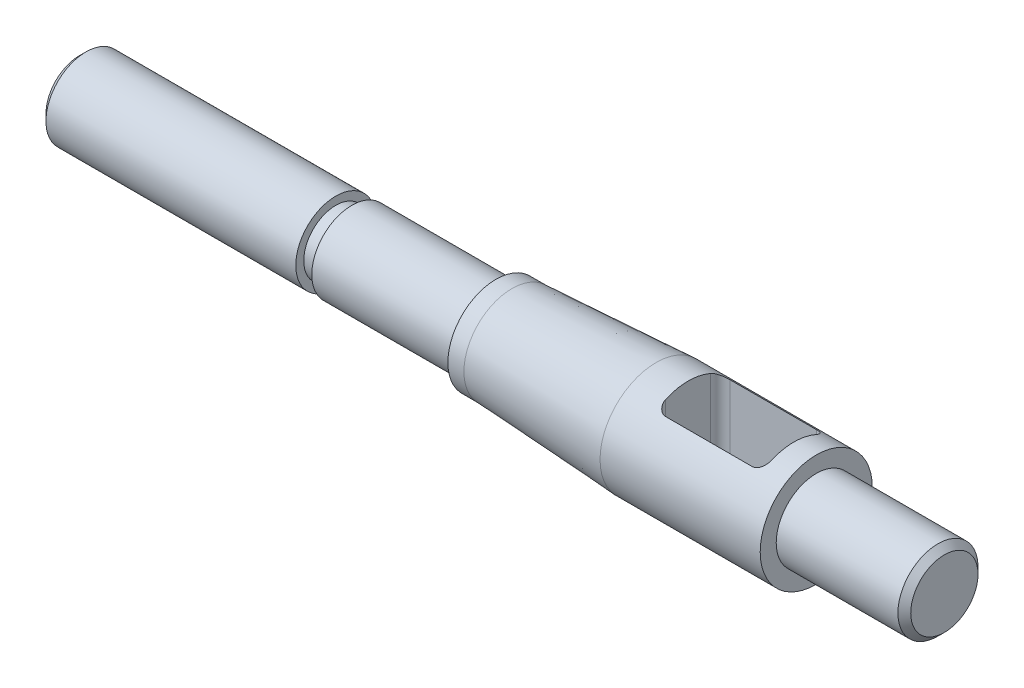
from build123d import *

# Parameters (mm, degrees)
ESQUISSE1_R             = 12.5
EXTRUSION1_DEPTH        = 130
ESQUISSE2_R             = 17.5
EXTRUSION2_DEPTH        = 100
ESQUISSE3_R             = 12.5
EXTRUSION3_DEPTH        = 40
ESQUISSE4_W             = 33
ESQUISSE4_H             = 35.055555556
ENL_V_MAT_EXTRU_1_DEPTH = 10
CHANFREIN1_SIZE         = 2
ESQUISSE6_W             = 5
ESQUISSE6_H             = 15.555555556
CONG_1_R                = 3


with BuildPart() as part:
    # Esquisse1 → Extrusion1 (new body)
    with BuildSketch(Plane(origin=(0, 0, 0), x_dir=(0, 0, -1), z_dir=(1, 0, 0))):
        Circle(ESQUISSE1_R)
    extrude(amount=EXTRUSION1_DEPTH)

    # Esquisse2 → Extrusion2 (add)
    with BuildSketch(Plane(origin=(130, 0, 0), x_dir=(0, 0, -1), z_dir=(1, 0, 0))):
        Circle(ESQUISSE2_R)
    extrude(amount=EXTRUSION2_DEPTH)

    # Esquisse3 → Extrusion3 (add)
    with BuildSketch(Plane(origin=(230, 0, 0), x_dir=(0, 0, -1), z_dir=(1, 0, 0))):
        Circle(ESQUISSE3_R)
    extrude(amount=EXTRUSION3_DEPTH)

    # Esquisse5 → Enl_vement de mati_re-R_volution1 (revolve, cut)
    with BuildSketch(Plane.XY, mode=Mode.PRIVATE) as enl_vement_de_mati_re_r_volution1_sk:
        Polygon((56.944444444, 25.78026534), (56.944444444, 15), (135, 15), (180, 17.5), (180, 30.555555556), align=None)
    revolve(enl_vement_de_mati_re_r_volution1_sk.sketch.rotate(Axis((0, 0, 0), (1, 0, 0)), 90), axis=Axis((0, 0, 0), (1, 0, 0)), mode=Mode.SUBTRACT)

    # Esquisse4 → Enl_v. mat.-Extru.1 (cut, symmetric)
    with BuildSketch(Plane.XY):
        with Locations((206.5, 5.527777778)):
            Rectangle(ESQUISSE4_W, ESQUISSE4_H)
    extrude(amount=ENL_V_MAT_EXTRU_1_DEPTH, both=True, mode=Mode.SUBTRACT)

    # Chanfrein1
    chanfrein1_edges = [part.edges().sort_by_distance(p)[0] for p in [
        (270, 0, 12.5),
        (0, 0, 12.5),
    ]]
    chamfer(chanfrein1_edges, length=CHANFREIN1_SIZE)

    # Esquisse6 → Enl_vement de mati_re-R_volution2 (revolve, cut)
    with BuildSketch(Plane.XY, mode=Mode.PRIVATE) as enl_vement_de_mati_re_r_volution2_sk:
        with Locations((82.5, 17.777777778)):
            Rectangle(ESQUISSE6_W, ESQUISSE6_H)
    revolve(enl_vement_de_mati_re_r_volution2_sk.sketch.rotate(Axis((0, 0, 0), (1, 0, 0)), 90), axis=Axis((0, 0, 0), (1, 0, 0)), mode=Mode.SUBTRACT)

    # Cong_1
    cong_1_edges = [part.edges().sort_by_distance(p)[0] for p in [
        (190, 1.180703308, -10),
        (190, -12, 0),
        (223, 1.180703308, -10),
        (223, 1.180703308, 10),
        (190, 1.180703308, 10),
        (206.5, -12, 10),
        (206.5, -12, -10),
        (223, -12, 0),
    ]]
    fillet(cong_1_edges, radius=CONG_1_R)


solid = part.part
